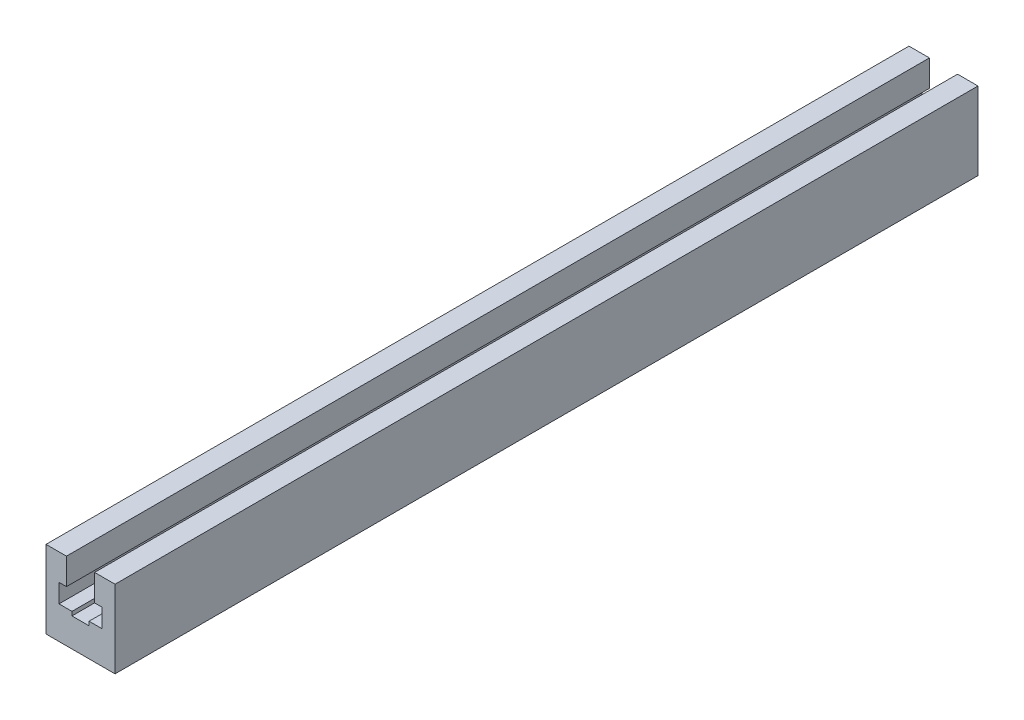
ISO-10303-21;
HEADER;
FILE_DESCRIPTION(('STEP AP214'),'2;1');
FILE_NAME('part.step','',(''),(''),'','','');
FILE_SCHEMA(('AUTOMOTIVE_DESIGN { 1 0 10303 214 1 1 1 1 }'));
ENDSEC;
DATA;
#1=APPLICATION_CONTEXT('core data for automotive mechanical design processes');
#2=APPLICATION_PROTOCOL_DEFINITION('international standard','automotive_design',2000,#1);
#3=PRODUCT_CONTEXT('',#1,'mechanical');
#4=PRODUCT('Part','Part','',(#3));
#5=PRODUCT_RELATED_PRODUCT_CATEGORY('part','',(#4));
#6=PRODUCT_DEFINITION_FORMATION('','',#4);
#7=PRODUCT_DEFINITION_CONTEXT('part definition',#1,'design');
#8=PRODUCT_DEFINITION('design','',#6,#7);
#9=PRODUCT_DEFINITION_SHAPE('','',#8);
#10=(LENGTH_UNIT() NAMED_UNIT(*) SI_UNIT(.MILLI.,.METRE.));
#11=(NAMED_UNIT(*) PLANE_ANGLE_UNIT() SI_UNIT($,.RADIAN.));
#12=(NAMED_UNIT(*) SI_UNIT($,.STERADIAN.) SOLID_ANGLE_UNIT());
#13=UNCERTAINTY_MEASURE_WITH_UNIT(LENGTH_MEASURE(1.E-05),#10,'distance_accuracy_value','');
#14=(GEOMETRIC_REPRESENTATION_CONTEXT(3) GLOBAL_UNCERTAINTY_ASSIGNED_CONTEXT((#13)) GLOBAL_UNIT_ASSIGNED_CONTEXT((#10,
#11,#12)) REPRESENTATION_CONTEXT('',''));
#15=CARTESIAN_POINT('',(0.,0.,0.));
#16=DIRECTION('',(0.,0.,1.));
#17=DIRECTION('',(1.,0.,0.));
#18=AXIS2_PLACEMENT_3D('',#15,#16,#17);
#19=CARTESIAN_POINT('',(-12.45,18.9,0.));
#20=DIRECTION('',(0.,-1.,0.));
#21=DIRECTION('',(1.,0.,0.));
#22=AXIS2_PLACEMENT_3D('',#19,#20,#21);
#23=PLANE('',#22);
#24=DIRECTION('',(1.,0.,0.));
#25=VECTOR('',#24,1.);
#26=CARTESIAN_POINT('',(-12.45,18.9,500.));
#27=LINE('',#26,#25);
#28=CARTESIAN_POINT('',(-12.45,18.9,500.));
#29=VERTEX_POINT('',#28);
#30=CARTESIAN_POINT('',(-4.95,18.9,500.));
#31=VERTEX_POINT('',#30);
#32=EDGE_CURVE('E183',#29,#31,#27,.T.);
#33=ORIENTED_EDGE('',*,*,#32,.T.);
#34=DIRECTION('',(0.,0.,1.));
#35=VECTOR('',#34,1.);
#36=CARTESIAN_POINT('',(-4.95,18.9,0.));
#37=LINE('',#36,#35);
#38=CARTESIAN_POINT('',(-4.95,18.9,0.));
#39=VERTEX_POINT('',#38);
#40=EDGE_CURVE('E155',#39,#31,#37,.T.);
#41=ORIENTED_EDGE('',*,*,#40,.F.);
#42=DIRECTION('',(1.,0.,0.));
#43=VECTOR('',#42,1.);
#44=CARTESIAN_POINT('',(-12.45,18.9,0.));
#45=LINE('',#44,#43);
#46=CARTESIAN_POINT('',(-12.45,18.9,0.));
#47=VERTEX_POINT('',#46);
#48=EDGE_CURVE('E146',#47,#39,#45,.T.);
#49=ORIENTED_EDGE('',*,*,#48,.F.);
#50=DIRECTION('',(0.,0.,1.));
#51=VECTOR('',#50,1.);
#52=CARTESIAN_POINT('',(-12.45,18.9,0.));
#53=LINE('',#52,#51);
#54=EDGE_CURVE('E247',#47,#29,#53,.T.);
#55=ORIENTED_EDGE('',*,*,#54,.T.);
#56=EDGE_LOOP('',(#33,#41,#49,#55));
#57=FACE_BOUND('',#56,.T.);
#58=ADVANCED_FACE('F14',(#57),#23,.F.);
#59=CARTESIAN_POINT('',(-20.,45.,0.));
#60=DIRECTION('',(-1.,0.,0.));
#61=DIRECTION('',(0.,0.,1.));
#62=AXIS2_PLACEMENT_3D('',#59,#60,#61);
#63=PLANE('',#62);
#64=DIRECTION('',(0.,0.,1.));
#65=VECTOR('',#64,1.);
#66=CARTESIAN_POINT('',(-20.,45.,0.));
#67=LINE('',#66,#65);
#68=CARTESIAN_POINT('',(-20.,45.,0.));
#69=VERTEX_POINT('',#68);
#70=CARTESIAN_POINT('',(-20.,45.,500.));
#71=VERTEX_POINT('',#70);
#72=EDGE_CURVE('E9',#69,#71,#67,.T.);
#73=ORIENTED_EDGE('',*,*,#72,.F.);
#74=DIRECTION('',(0.,-1.,0.));
#75=VECTOR('',#74,1.);
#76=CARTESIAN_POINT('',(-20.,45.,0.));
#77=LINE('',#76,#75);
#78=CARTESIAN_POINT('',(-20.,0.,0.));
#79=VERTEX_POINT('',#78);
#80=EDGE_CURVE('E198',#69,#79,#77,.T.);
#81=ORIENTED_EDGE('',*,*,#80,.T.);
#82=DIRECTION('',(0.,0.,1.));
#83=VECTOR('',#82,1.);
#84=CARTESIAN_POINT('',(-20.,0.,0.));
#85=LINE('',#84,#83);
#86=CARTESIAN_POINT('',(-20.,0.,500.));
#87=VERTEX_POINT('',#86);
#88=EDGE_CURVE('E232',#79,#87,#85,.T.);
#89=ORIENTED_EDGE('',*,*,#88,.T.);
#90=DIRECTION('',(0.,-1.,0.));
#91=VECTOR('',#90,1.);
#92=CARTESIAN_POINT('',(-20.,45.,500.));
#93=LINE('',#92,#91);
#94=EDGE_CURVE('E157',#71,#87,#93,.T.);
#95=ORIENTED_EDGE('',*,*,#94,.F.);
#96=EDGE_LOOP('',(#73,#81,#89,#95));
#97=FACE_BOUND('',#96,.T.);
#98=ADVANCED_FACE('F262',(#97),#63,.T.);
#99=CARTESIAN_POINT('',(-20.,45.,0.));
#100=DIRECTION('',(0.,-1.,0.));
#101=DIRECTION('',(1.,0.,0.));
#102=AXIS2_PLACEMENT_3D('',#99,#100,#101);
#103=PLANE('',#102);
#104=DIRECTION('',(0.,0.,1.));
#105=VECTOR('',#104,1.);
#106=CARTESIAN_POINT('',(-8.15,45.,0.));
#107=LINE('',#106,#105);
#108=CARTESIAN_POINT('',(-8.15,45.,0.));
#109=VERTEX_POINT('',#108);
#110=CARTESIAN_POINT('',(-8.15,45.,500.));
#111=VERTEX_POINT('',#110);
#112=EDGE_CURVE('E22',#109,#111,#107,.T.);
#113=ORIENTED_EDGE('',*,*,#112,.F.);
#114=DIRECTION('',(1.,0.,0.));
#115=VECTOR('',#114,1.);
#116=CARTESIAN_POINT('',(-20.,45.,0.));
#117=LINE('',#116,#115);
#118=EDGE_CURVE('E229',#69,#109,#117,.T.);
#119=ORIENTED_EDGE('',*,*,#118,.F.);
#120=ORIENTED_EDGE('',*,*,#72,.T.);
#121=DIRECTION('',(1.,0.,0.));
#122=VECTOR('',#121,1.);
#123=CARTESIAN_POINT('',(-20.,45.,500.));
#124=LINE('',#123,#122);
#125=EDGE_CURVE('E195',#71,#111,#124,.T.);
#126=ORIENTED_EDGE('',*,*,#125,.T.);
#127=EDGE_LOOP('',(#113,#119,#120,#126));
#128=FACE_BOUND('',#127,.T.);
#129=ADVANCED_FACE('F16',(#128),#103,.F.);
#130=CARTESIAN_POINT('',(-8.15,29.7,0.));
#131=DIRECTION('',(1.,0.,0.));
#132=DIRECTION('',(0.,0.,-1.));
#133=AXIS2_PLACEMENT_3D('',#130,#131,#132);
#134=PLANE('',#133);
#135=DIRECTION('',(0.,0.,1.));
#136=VECTOR('',#135,1.);
#137=CARTESIAN_POINT('',(-8.15,29.7,0.));
#138=LINE('',#137,#136);
#139=CARTESIAN_POINT('',(-8.15,29.7,0.));
#140=VERTEX_POINT('',#139);
#141=CARTESIAN_POINT('',(-8.15,29.7,500.));
#142=VERTEX_POINT('',#141);
#143=EDGE_CURVE('E251',#140,#142,#138,.T.);
#144=ORIENTED_EDGE('',*,*,#143,.F.);
#145=DIRECTION('',(0.,1.,0.));
#146=VECTOR('',#145,1.);
#147=CARTESIAN_POINT('',(-8.15,29.7,0.));
#148=LINE('',#147,#146);
#149=EDGE_CURVE('E226',#140,#109,#148,.T.);
#150=ORIENTED_EDGE('',*,*,#149,.T.);
#151=ORIENTED_EDGE('',*,*,#112,.T.);
#152=DIRECTION('',(0.,1.,0.));
#153=VECTOR('',#152,1.);
#154=CARTESIAN_POINT('',(-8.15,29.7,500.));
#155=LINE('',#154,#153);
#156=EDGE_CURVE('E192',#142,#111,#155,.T.);
#157=ORIENTED_EDGE('',*,*,#156,.F.);
#158=EDGE_LOOP('',(#144,#150,#151,#157));
#159=FACE_BOUND('',#158,.T.);
#160=ADVANCED_FACE('F254',(#159),#134,.T.);
#161=CARTESIAN_POINT('',(-12.45,29.7,0.));
#162=DIRECTION('',(0.,-1.,0.));
#163=DIRECTION('',(0.,0.,-1.));
#164=AXIS2_PLACEMENT_3D('',#161,#162,#163);
#165=PLANE('',#164);
#166=DIRECTION('',(0.,0.,1.));
#167=VECTOR('',#166,1.);
#168=CARTESIAN_POINT('',(-12.45,29.7,0.));
#169=LINE('',#168,#167);
#170=CARTESIAN_POINT('',(-12.45,29.7,0.));
#171=VERTEX_POINT('',#170);
#172=CARTESIAN_POINT('',(-12.45,29.7,500.));
#173=VERTEX_POINT('',#172);
#174=EDGE_CURVE('E249',#171,#173,#169,.T.);
#175=ORIENTED_EDGE('',*,*,#174,.F.);
#176=DIRECTION('',(1.,0.,0.));
#177=VECTOR('',#176,1.);
#178=CARTESIAN_POINT('',(-12.45,29.7,0.));
#179=LINE('',#178,#177);
#180=EDGE_CURVE('E223',#171,#140,#179,.T.);
#181=ORIENTED_EDGE('',*,*,#180,.T.);
#182=ORIENTED_EDGE('',*,*,#143,.T.);
#183=DIRECTION('',(1.,0.,0.));
#184=VECTOR('',#183,1.);
#185=CARTESIAN_POINT('',(-12.45,29.7,500.));
#186=LINE('',#185,#184);
#187=EDGE_CURVE('E189',#173,#142,#186,.T.);
#188=ORIENTED_EDGE('',*,*,#187,.F.);
#189=EDGE_LOOP('',(#175,#181,#182,#188));
#190=FACE_BOUND('',#189,.T.);
#191=ADVANCED_FACE('F297',(#190),#165,.T.);
#192=CARTESIAN_POINT('',(-12.45,18.9,0.));
#193=DIRECTION('',(1.,0.,0.));
#194=DIRECTION('',(0.,0.,-1.));
#195=AXIS2_PLACEMENT_3D('',#192,#193,#194);
#196=PLANE('',#195);
#197=ORIENTED_EDGE('',*,*,#54,.F.);
#198=DIRECTION('',(0.,1.,0.));
#199=VECTOR('',#198,1.);
#200=CARTESIAN_POINT('',(-12.45,18.9,0.));
#201=LINE('',#200,#199);
#202=EDGE_CURVE('E220',#47,#171,#201,.T.);
#203=ORIENTED_EDGE('',*,*,#202,.T.);
#204=ORIENTED_EDGE('',*,*,#174,.T.);
#205=DIRECTION('',(0.,1.,0.));
#206=VECTOR('',#205,1.);
#207=CARTESIAN_POINT('',(-12.45,18.9,500.));
#208=LINE('',#207,#206);
#209=EDGE_CURVE('E186',#29,#173,#208,.T.);
#210=ORIENTED_EDGE('',*,*,#209,.F.);
#211=EDGE_LOOP('',(#197,#203,#204,#210));
#212=FACE_BOUND('',#211,.T.);
#213=ADVANCED_FACE('F300',(#212),#196,.T.);
#214=CARTESIAN_POINT('',(4.95,18.9,0.));
#215=VERTEX_POINT('',#214);
#216=CARTESIAN_POINT('',(12.45,18.9,0.));
#217=VERTEX_POINT('',#216);
#218=EDGE_CURVE('E218',#215,#217,#45,.T.);
#219=ORIENTED_EDGE('',*,*,#218,.F.);
#220=DIRECTION('',(0.,0.,1.));
#221=VECTOR('',#220,1.);
#222=CARTESIAN_POINT('',(4.95,18.9,0.));
#223=LINE('',#222,#221);
#224=CARTESIAN_POINT('',(4.95,18.9,500.));
#225=VERTEX_POINT('',#224);
#226=EDGE_CURVE('E158',#215,#225,#223,.T.);
#227=ORIENTED_EDGE('',*,*,#226,.T.);
#228=CARTESIAN_POINT('',(12.45,18.9,500.));
#229=VERTEX_POINT('',#228);
#230=EDGE_CURVE('E182',#225,#229,#27,.T.);
#231=ORIENTED_EDGE('',*,*,#230,.T.);
#232=DIRECTION('',(0.,0.,1.));
#233=VECTOR('',#232,1.);
#234=CARTESIAN_POINT('',(12.45,18.9,0.));
#235=LINE('',#234,#233);
#236=EDGE_CURVE('E244',#217,#229,#235,.T.);
#237=ORIENTED_EDGE('',*,*,#236,.F.);
#238=EDGE_LOOP('',(#219,#227,#231,#237));
#239=FACE_BOUND('',#238,.T.);
#240=ADVANCED_FACE('F292',(#239),#23,.F.);
#241=CARTESIAN_POINT('',(12.45,18.9,0.));
#242=DIRECTION('',(1.,0.,0.));
#243=DIRECTION('',(0.,0.,-1.));
#244=AXIS2_PLACEMENT_3D('',#241,#242,#243);
#245=PLANE('',#244);
#246=DIRECTION('',(0.,0.,1.));
#247=VECTOR('',#246,1.);
#248=CARTESIAN_POINT('',(12.45,29.7,0.));
#249=LINE('',#248,#247);
#250=CARTESIAN_POINT('',(12.45,29.7,0.));
#251=VERTEX_POINT('',#250);
#252=CARTESIAN_POINT('',(12.45,29.7,500.));
#253=VERTEX_POINT('',#252);
#254=EDGE_CURVE('E242',#251,#253,#249,.T.);
#255=ORIENTED_EDGE('',*,*,#254,.F.);
#256=DIRECTION('',(0.,1.,0.));
#257=VECTOR('',#256,1.);
#258=CARTESIAN_POINT('',(12.45,18.9,0.));
#259=LINE('',#258,#257);
#260=EDGE_CURVE('E215',#217,#251,#259,.T.);
#261=ORIENTED_EDGE('',*,*,#260,.F.);
#262=ORIENTED_EDGE('',*,*,#236,.T.);
#263=DIRECTION('',(0.,1.,0.));
#264=VECTOR('',#263,1.);
#265=CARTESIAN_POINT('',(12.45,18.9,500.));
#266=LINE('',#265,#264);
#267=EDGE_CURVE('E179',#229,#253,#266,.T.);
#268=ORIENTED_EDGE('',*,*,#267,.T.);
#269=EDGE_LOOP('',(#255,#261,#262,#268));
#270=FACE_BOUND('',#269,.T.);
#271=ADVANCED_FACE('F286',(#270),#245,.F.);
#272=CARTESIAN_POINT('',(8.15000000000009,29.7,0.));
#273=DIRECTION('',(0.,-1.,0.));
#274=DIRECTION('',(0.,0.,-1.));
#275=AXIS2_PLACEMENT_3D('',#272,#273,#274);
#276=PLANE('',#275);
#277=DIRECTION('',(0.,0.,1.));
#278=VECTOR('',#277,1.);
#279=CARTESIAN_POINT('',(8.15000000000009,29.7,0.));
#280=LINE('',#279,#278);
#281=CARTESIAN_POINT('',(8.15000000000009,29.7,0.));
#282=VERTEX_POINT('',#281);
#283=CARTESIAN_POINT('',(8.15000000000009,29.7,500.));
#284=VERTEX_POINT('',#283);
#285=EDGE_CURVE('E240',#282,#284,#280,.T.);
#286=ORIENTED_EDGE('',*,*,#285,.F.);
#287=DIRECTION('',(1.,0.,0.));
#288=VECTOR('',#287,1.);
#289=CARTESIAN_POINT('',(8.15000000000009,29.7,0.));
#290=LINE('',#289,#288);
#291=EDGE_CURVE('E212',#282,#251,#290,.T.);
#292=ORIENTED_EDGE('',*,*,#291,.T.);
#293=ORIENTED_EDGE('',*,*,#254,.T.);
#294=DIRECTION('',(1.,0.,0.));
#295=VECTOR('',#294,1.);
#296=CARTESIAN_POINT('',(8.15000000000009,29.7,500.));
#297=LINE('',#296,#295);
#298=EDGE_CURVE('E176',#284,#253,#297,.T.);
#299=ORIENTED_EDGE('',*,*,#298,.F.);
#300=EDGE_LOOP('',(#286,#292,#293,#299));
#301=FACE_BOUND('',#300,.T.);
#302=ADVANCED_FACE('F283',(#301),#276,.T.);
#303=CARTESIAN_POINT('',(8.15000000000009,29.7,0.));
#304=DIRECTION('',(1.,0.,0.));
#305=DIRECTION('',(0.,1.,0.));
#306=AXIS2_PLACEMENT_3D('',#303,#304,#305);
#307=PLANE('',#306);
#308=DIRECTION('',(0.,0.,1.));
#309=VECTOR('',#308,1.);
#310=CARTESIAN_POINT('',(8.15,45.,0.));
#311=LINE('',#310,#309);
#312=CARTESIAN_POINT('',(8.15,45.,0.));
#313=VERTEX_POINT('',#312);
#314=CARTESIAN_POINT('',(8.15,45.,500.));
#315=VERTEX_POINT('',#314);
#316=EDGE_CURVE('E238',#313,#315,#311,.T.);
#317=ORIENTED_EDGE('',*,*,#316,.F.);
#318=DIRECTION('',(0.,1.,0.));
#319=VECTOR('',#318,1.);
#320=CARTESIAN_POINT('',(8.15000000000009,29.7,0.));
#321=LINE('',#320,#319);
#322=EDGE_CURVE('E209',#282,#313,#321,.T.);
#323=ORIENTED_EDGE('',*,*,#322,.F.);
#324=ORIENTED_EDGE('',*,*,#285,.T.);
#325=DIRECTION('',(0.,1.,0.));
#326=VECTOR('',#325,1.);
#327=CARTESIAN_POINT('',(8.15000000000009,29.7,500.));
#328=LINE('',#327,#326);
#329=EDGE_CURVE('E173',#284,#315,#328,.T.);
#330=ORIENTED_EDGE('',*,*,#329,.T.);
#331=EDGE_LOOP('',(#317,#323,#324,#330));
#332=FACE_BOUND('',#331,.T.);
#333=ADVANCED_FACE('F278',(#332),#307,.F.);
#334=CARTESIAN_POINT('',(8.15,45.,0.));
#335=DIRECTION('',(0.,-1.,0.));
#336=DIRECTION('',(1.,0.,0.));
#337=AXIS2_PLACEMENT_3D('',#334,#335,#336);
#338=PLANE('',#337);
#339=DIRECTION('',(0.,0.,1.));
#340=VECTOR('',#339,1.);
#341=CARTESIAN_POINT('',(20.,45.,0.));
#342=LINE('',#341,#340);
#343=CARTESIAN_POINT('',(20.,45.,0.));
#344=VERTEX_POINT('',#343);
#345=CARTESIAN_POINT('',(20.,45.,500.));
#346=VERTEX_POINT('',#345);
#347=EDGE_CURVE('E236',#344,#346,#342,.T.);
#348=ORIENTED_EDGE('',*,*,#347,.F.);
#349=DIRECTION('',(1.,0.,0.));
#350=VECTOR('',#349,1.);
#351=CARTESIAN_POINT('',(8.15,45.,0.));
#352=LINE('',#351,#350);
#353=EDGE_CURVE('E206',#313,#344,#352,.T.);
#354=ORIENTED_EDGE('',*,*,#353,.F.);
#355=ORIENTED_EDGE('',*,*,#316,.T.);
#356=DIRECTION('',(1.,0.,0.));
#357=VECTOR('',#356,1.);
#358=CARTESIAN_POINT('',(8.15,45.,500.));
#359=LINE('',#358,#357);
#360=EDGE_CURVE('E170',#315,#346,#359,.T.);
#361=ORIENTED_EDGE('',*,*,#360,.T.);
#362=EDGE_LOOP('',(#348,#354,#355,#361));
#363=FACE_BOUND('',#362,.T.);
#364=ADVANCED_FACE('F274',(#363),#338,.F.);
#365=CARTESIAN_POINT('',(20.,45.,0.));
#366=DIRECTION('',(-1.,0.,0.));
#367=DIRECTION('',(0.,0.,1.));
#368=AXIS2_PLACEMENT_3D('',#365,#366,#367);
#369=PLANE('',#368);
#370=DIRECTION('',(0.,0.,1.));
#371=VECTOR('',#370,1.);
#372=CARTESIAN_POINT('',(20.,0.,0.));
#373=LINE('',#372,#371);
#374=CARTESIAN_POINT('',(20.,0.,0.));
#375=VERTEX_POINT('',#374);
#376=CARTESIAN_POINT('',(20.,0.,500.));
#377=VERTEX_POINT('',#376);
#378=EDGE_CURVE('E234',#375,#377,#373,.T.);
#379=ORIENTED_EDGE('',*,*,#378,.F.);
#380=DIRECTION('',(0.,-1.,0.));
#381=VECTOR('',#380,1.);
#382=CARTESIAN_POINT('',(20.,45.,0.));
#383=LINE('',#382,#381);
#384=EDGE_CURVE('E203',#344,#375,#383,.T.);
#385=ORIENTED_EDGE('',*,*,#384,.F.);
#386=ORIENTED_EDGE('',*,*,#347,.T.);
#387=DIRECTION('',(0.,-1.,0.));
#388=VECTOR('',#387,1.);
#389=CARTESIAN_POINT('',(20.,45.,500.));
#390=LINE('',#389,#388);
#391=EDGE_CURVE('E167',#346,#377,#390,.T.);
#392=ORIENTED_EDGE('',*,*,#391,.T.);
#393=EDGE_LOOP('',(#379,#385,#386,#392));
#394=FACE_BOUND('',#393,.T.);
#395=ADVANCED_FACE('F270',(#394),#369,.F.);
#396=CARTESIAN_POINT('',(-20.,0.,0.));
#397=DIRECTION('',(0.,-1.,0.));
#398=DIRECTION('',(0.,0.,-1.));
#399=AXIS2_PLACEMENT_3D('',#396,#397,#398);
#400=PLANE('',#399);
#401=DIRECTION('',(1.,0.,0.));
#402=VECTOR('',#401,1.);
#403=CARTESIAN_POINT('',(-20.,0.,0.));
#404=LINE('',#403,#402);
#405=EDGE_CURVE('E200',#79,#375,#404,.T.);
#406=ORIENTED_EDGE('',*,*,#405,.T.);
#407=ORIENTED_EDGE('',*,*,#378,.T.);
#408=DIRECTION('',(1.,0.,0.));
#409=VECTOR('',#408,1.);
#410=CARTESIAN_POINT('',(-20.,0.,500.));
#411=LINE('',#410,#409);
#412=EDGE_CURVE('E164',#87,#377,#411,.T.);
#413=ORIENTED_EDGE('',*,*,#412,.F.);
#414=ORIENTED_EDGE('',*,*,#88,.F.);
#415=EDGE_LOOP('',(#406,#407,#413,#414));
#416=FACE_BOUND('',#415,.T.);
#417=ADVANCED_FACE('F266',(#416),#400,.T.);
#418=CARTESIAN_POINT('',(-20.,0.,0.));
#419=DIRECTION('',(0.,0.,1.));
#420=DIRECTION('',(1.,0.,0.));
#421=AXIS2_PLACEMENT_3D('',#418,#419,#420);
#422=PLANE('',#421);
#423=ORIENTED_EDGE('',*,*,#48,.T.);
#424=DIRECTION('',(0.,-1.,0.));
#425=VECTOR('',#424,1.);
#426=CARTESIAN_POINT('',(-4.95,18.9,0.));
#427=LINE('',#426,#425);
#428=CARTESIAN_POINT('',(-4.95,16.6,0.));
#429=VERTEX_POINT('',#428);
#430=EDGE_CURVE('E127',#39,#429,#427,.T.);
#431=ORIENTED_EDGE('',*,*,#430,.T.);
#432=DIRECTION('',(1.,0.,0.));
#433=VECTOR('',#432,1.);
#434=CARTESIAN_POINT('',(-4.95,16.6,0.));
#435=LINE('',#434,#433);
#436=CARTESIAN_POINT('',(4.95,16.6,0.));
#437=VERTEX_POINT('',#436);
#438=EDGE_CURVE('E136',#429,#437,#435,.T.);
#439=ORIENTED_EDGE('',*,*,#438,.T.);
#440=DIRECTION('',(0.,1.,0.));
#441=VECTOR('',#440,1.);
#442=CARTESIAN_POINT('',(4.95,18.9,0.));
#443=LINE('',#442,#441);
#444=EDGE_CURVE('E133',#437,#215,#443,.T.);
#445=ORIENTED_EDGE('',*,*,#444,.T.);
#446=ORIENTED_EDGE('',*,*,#218,.T.);
#447=ORIENTED_EDGE('',*,*,#260,.T.);
#448=ORIENTED_EDGE('',*,*,#291,.F.);
#449=ORIENTED_EDGE('',*,*,#322,.T.);
#450=ORIENTED_EDGE('',*,*,#353,.T.);
#451=ORIENTED_EDGE('',*,*,#384,.T.);
#452=ORIENTED_EDGE('',*,*,#405,.F.);
#453=ORIENTED_EDGE('',*,*,#80,.F.);
#454=ORIENTED_EDGE('',*,*,#118,.T.);
#455=ORIENTED_EDGE('',*,*,#149,.F.);
#456=ORIENTED_EDGE('',*,*,#180,.F.);
#457=ORIENTED_EDGE('',*,*,#202,.F.);
#458=EDGE_LOOP('',(#423,#431,#439,#445,#446,#447,#448,#449,#450,#451,#452,#453,#454,#455,#456,#457));
#459=FACE_BOUND('',#458,.T.);
#460=ADVANCED_FACE('F143',(#459),#422,.F.);
#461=CARTESIAN_POINT('',(-20.,0.,500.));
#462=DIRECTION('',(0.,0.,1.));
#463=DIRECTION('',(1.,0.,0.));
#464=AXIS2_PLACEMENT_3D('',#461,#462,#463);
#465=PLANE('',#464);
#466=DIRECTION('',(0.,-1.,0.));
#467=VECTOR('',#466,1.);
#468=CARTESIAN_POINT('',(-4.95,18.9,500.));
#469=LINE('',#468,#467);
#470=CARTESIAN_POINT('',(-4.95,16.6,500.));
#471=VERTEX_POINT('',#470);
#472=EDGE_CURVE('E29',#31,#471,#469,.T.);
#473=ORIENTED_EDGE('',*,*,#472,.F.);
#474=ORIENTED_EDGE('',*,*,#32,.F.);
#475=ORIENTED_EDGE('',*,*,#209,.T.);
#476=ORIENTED_EDGE('',*,*,#187,.T.);
#477=ORIENTED_EDGE('',*,*,#156,.T.);
#478=ORIENTED_EDGE('',*,*,#125,.F.);
#479=ORIENTED_EDGE('',*,*,#94,.T.);
#480=ORIENTED_EDGE('',*,*,#412,.T.);
#481=ORIENTED_EDGE('',*,*,#391,.F.);
#482=ORIENTED_EDGE('',*,*,#360,.F.);
#483=ORIENTED_EDGE('',*,*,#329,.F.);
#484=ORIENTED_EDGE('',*,*,#298,.T.);
#485=ORIENTED_EDGE('',*,*,#267,.F.);
#486=ORIENTED_EDGE('',*,*,#230,.F.);
#487=DIRECTION('',(0.,1.,0.));
#488=VECTOR('',#487,1.);
#489=CARTESIAN_POINT('',(4.95,18.9,500.));
#490=LINE('',#489,#488);
#491=CARTESIAN_POINT('',(4.95,16.6,500.));
#492=VERTEX_POINT('',#491);
#493=EDGE_CURVE('E147',#492,#225,#490,.T.);
#494=ORIENTED_EDGE('',*,*,#493,.F.);
#495=DIRECTION('',(1.,0.,0.));
#496=VECTOR('',#495,1.);
#497=CARTESIAN_POINT('',(-4.95,16.6,500.));
#498=LINE('',#497,#496);
#499=EDGE_CURVE('E149',#471,#492,#498,.T.);
#500=ORIENTED_EDGE('',*,*,#499,.F.);
#501=EDGE_LOOP('',(#473,#474,#475,#476,#477,#478,#479,#480,#481,#482,#483,#484,#485,#486,#494,#500));
#502=FACE_BOUND('',#501,.T.);
#503=ADVANCED_FACE('F260',(#502),#465,.T.);
#504=CARTESIAN_POINT('',(-4.95,18.9,0.));
#505=DIRECTION('',(-1.,0.,0.));
#506=DIRECTION('',(0.,0.,1.));
#507=AXIS2_PLACEMENT_3D('',#504,#505,#506);
#508=PLANE('',#507);
#509=ORIENTED_EDGE('',*,*,#472,.T.);
#510=DIRECTION('',(0.,0.,1.));
#511=VECTOR('',#510,1.);
#512=CARTESIAN_POINT('',(-4.95,16.6,0.));
#513=LINE('',#512,#511);
#514=EDGE_CURVE('E123',#429,#471,#513,.T.);
#515=ORIENTED_EDGE('',*,*,#514,.F.);
#516=ORIENTED_EDGE('',*,*,#430,.F.);
#517=ORIENTED_EDGE('',*,*,#40,.T.);
#518=EDGE_LOOP('',(#509,#515,#516,#517));
#519=FACE_BOUND('',#518,.T.);
#520=ADVANCED_FACE('F125',(#519),#508,.F.);
#521=CARTESIAN_POINT('',(4.95,18.9,0.));
#522=DIRECTION('',(1.,0.,0.));
#523=DIRECTION('',(0.,1.,0.));
#524=AXIS2_PLACEMENT_3D('',#521,#522,#523);
#525=PLANE('',#524);
#526=ORIENTED_EDGE('',*,*,#493,.T.);
#527=ORIENTED_EDGE('',*,*,#226,.F.);
#528=ORIENTED_EDGE('',*,*,#444,.F.);
#529=DIRECTION('',(0.,0.,1.));
#530=VECTOR('',#529,1.);
#531=CARTESIAN_POINT('',(4.95,16.6,0.));
#532=LINE('',#531,#530);
#533=EDGE_CURVE('E132',#437,#492,#532,.T.);
#534=ORIENTED_EDGE('',*,*,#533,.T.);
#535=EDGE_LOOP('',(#526,#527,#528,#534));
#536=FACE_BOUND('',#535,.T.);
#537=ADVANCED_FACE('F294',(#536),#525,.F.);
#538=CARTESIAN_POINT('',(-4.95,16.6,0.));
#539=DIRECTION('',(0.,-1.,0.));
#540=DIRECTION('',(0.,0.,-1.));
#541=AXIS2_PLACEMENT_3D('',#538,#539,#540);
#542=PLANE('',#541);
#543=ORIENTED_EDGE('',*,*,#499,.T.);
#544=ORIENTED_EDGE('',*,*,#533,.F.);
#545=ORIENTED_EDGE('',*,*,#438,.F.);
#546=ORIENTED_EDGE('',*,*,#514,.T.);
#547=EDGE_LOOP('',(#543,#544,#545,#546));
#548=FACE_BOUND('',#547,.T.);
#549=ADVANCED_FACE('F137',(#548),#542,.F.);
#550=CLOSED_SHELL('',(#58,#98,#129,#160,#191,#213,#240,#271,#302,#333,#364,#395,#417,#460,#503,
#520,#537,#549));
#551=MANIFOLD_SOLID_BREP('B1',#550);
#552=ADVANCED_BREP_SHAPE_REPRESENTATION('',(#18,#551),#14);
#553=SHAPE_DEFINITION_REPRESENTATION(#9,#552);
ENDSEC;
END-ISO-10303-21;
